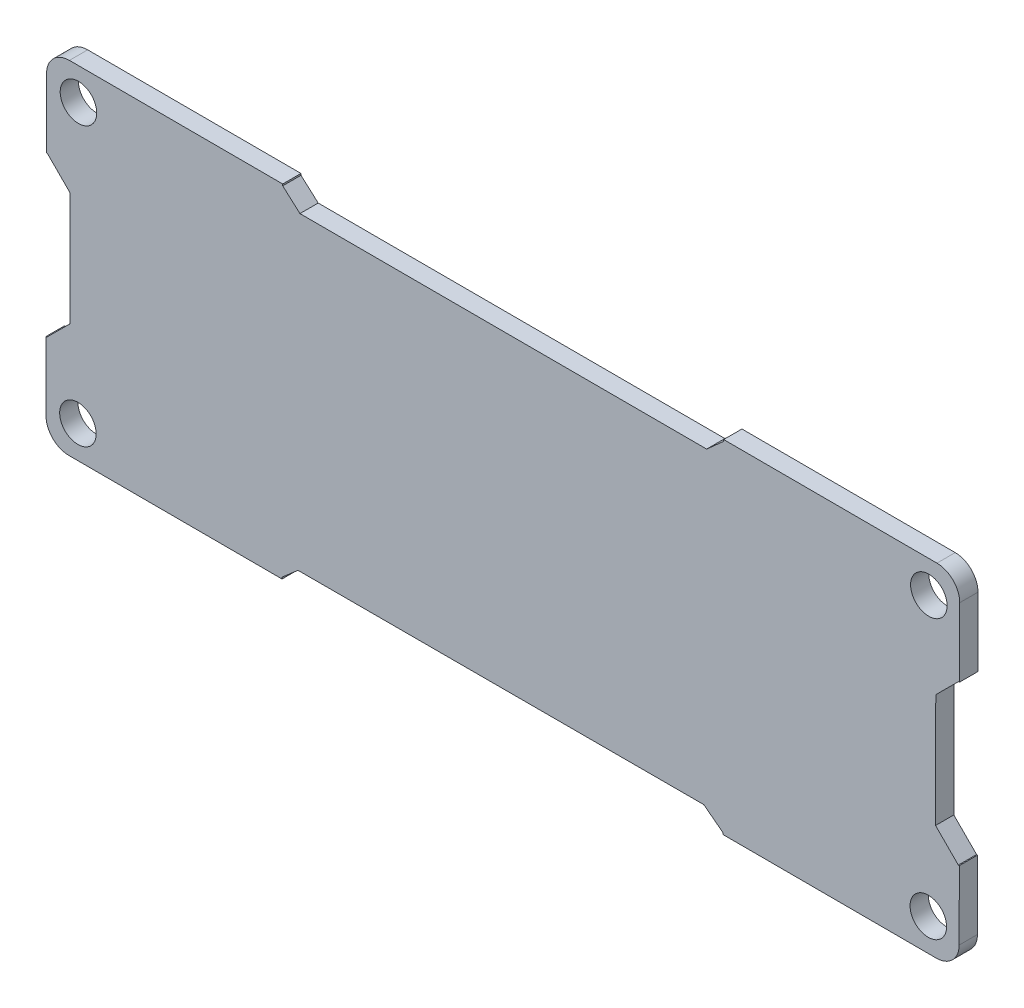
ISO-10303-21;
HEADER;
FILE_DESCRIPTION(('STEP AP214'),'2;1');
FILE_NAME('part.step','',(''),(''),'','','');
FILE_SCHEMA(('AUTOMOTIVE_DESIGN { 1 0 10303 214 1 1 1 1 }'));
ENDSEC;
DATA;
#1=APPLICATION_CONTEXT('core data for automotive mechanical design processes');
#2=APPLICATION_PROTOCOL_DEFINITION('international standard','automotive_design',2000,#1);
#3=PRODUCT_CONTEXT('',#1,'mechanical');
#4=PRODUCT('Part','Part','',(#3));
#5=PRODUCT_RELATED_PRODUCT_CATEGORY('part','',(#4));
#6=PRODUCT_DEFINITION_FORMATION('','',#4);
#7=PRODUCT_DEFINITION_CONTEXT('part definition',#1,'design');
#8=PRODUCT_DEFINITION('design','',#6,#7);
#9=PRODUCT_DEFINITION_SHAPE('','',#8);
#10=(LENGTH_UNIT() NAMED_UNIT(*) SI_UNIT(.MILLI.,.METRE.));
#11=(NAMED_UNIT(*) PLANE_ANGLE_UNIT() SI_UNIT($,.RADIAN.));
#12=(NAMED_UNIT(*) SI_UNIT($,.STERADIAN.) SOLID_ANGLE_UNIT());
#13=UNCERTAINTY_MEASURE_WITH_UNIT(LENGTH_MEASURE(1.E-05),#10,'distance_accuracy_value','');
#14=(GEOMETRIC_REPRESENTATION_CONTEXT(3) GLOBAL_UNCERTAINTY_ASSIGNED_CONTEXT((#13)) GLOBAL_UNIT_ASSIGNED_CONTEXT((#10,
#11,#12)) REPRESENTATION_CONTEXT('',''));
#15=CARTESIAN_POINT('',(0.,0.,0.));
#16=DIRECTION('',(0.,0.,1.));
#17=DIRECTION('',(1.,0.,0.));
#18=AXIS2_PLACEMENT_3D('',#15,#16,#17);
#19=CARTESIAN_POINT('',(-0.747475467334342,25.1714561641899,1.6));
#20=DIRECTION('',(0.,0.,1.));
#21=DIRECTION('',(1.,0.,0.));
#22=AXIS2_PLACEMENT_3D('',#19,#20,#21);
#23=PLANE('',#22);
#24=CARTESIAN_POINT('',(0.0460258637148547,24.3769565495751,1.6));
#25=DIRECTION('',(0.,0.,1.));
#26=DIRECTION('',(1.,0.,0.));
#27=AXIS2_PLACEMENT_3D('',#24,#25,#26);
#28=CIRCLE('',#27,1.6);
#29=CARTESIAN_POINT('',(1.64602586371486,24.3769565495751,1.6));
#30=VERTEX_POINT('',#29);
#31=EDGE_CURVE('E660',#30,#30,#28,.T.);
#32=ORIENTED_EDGE('',*,*,#31,.F.);
#33=EDGE_LOOP('',(#32));
#34=FACE_BOUND('',#33,.T.);
#35=CARTESIAN_POINT('',(74.5448930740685,24.2362960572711,1.6));
#36=DIRECTION('',(0.,0.,1.));
#37=DIRECTION('',(1.,0.,0.));
#38=AXIS2_PLACEMENT_3D('',#35,#36,#37);
#39=CIRCLE('',#38,1.60000000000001);
#40=CARTESIAN_POINT('',(76.1448930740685,24.2362960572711,1.6));
#41=VERTEX_POINT('',#40);
#42=EDGE_CURVE('E298',#41,#41,#39,.T.);
#43=ORIENTED_EDGE('',*,*,#42,.F.);
#44=EDGE_LOOP('',(#43));
#45=FACE_BOUND('',#44,.T.);
#46=DIRECTION('',(-0.00188808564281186,-0.999998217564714,0.));
#47=VECTOR('',#46,1.);
#48=CARTESIAN_POINT('',(-0.696399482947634,7.20399436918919,1.6));
#49=LINE('',#48,#47);
#50=CARTESIAN_POINT('',(-0.677641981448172,17.1386433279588,1.6));
#51=VERTEX_POINT('',#50);
#52=CARTESIAN_POINT('',(-0.696399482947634,7.20399436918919,1.6));
#53=VERTEX_POINT('',#52);
#54=EDGE_CURVE('E388',#51,#53,#49,.T.);
#55=ORIENTED_EDGE('',*,*,#54,.T.);
#56=DIRECTION('',(-0.708440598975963,-0.705770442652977,0.));
#57=VECTOR('',#56,1.);
#58=CARTESIAN_POINT('',(-2.70017208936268,5.20777410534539,1.6));
#59=LINE('',#58,#57);
#60=CARTESIAN_POINT('',(-2.70017208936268,5.20777410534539,1.6));
#61=VERTEX_POINT('',#60);
#62=EDGE_CURVE('E180',#53,#61,#59,.T.);
#63=ORIENTED_EDGE('',*,*,#62,.T.);
#64=DIRECTION('',(-0.999998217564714,0.00188808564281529,0.));
#65=VECTOR('',#64,1.);
#66=CARTESIAN_POINT('',(-2.78517193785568,5.20793459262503,1.6));
#67=LINE('',#66,#65);
#68=CARTESIAN_POINT('',(-2.78517193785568,5.20793459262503,1.6));
#69=VERTEX_POINT('',#68);
#70=EDGE_CURVE('E505',#61,#69,#67,.T.);
#71=ORIENTED_EDGE('',*,*,#70,.T.);
#72=DIRECTION('',(-0.00188808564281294,-0.999998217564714,0.));
#73=VECTOR('',#72,1.);
#74=CARTESIAN_POINT('',(-2.7965621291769,-0.824721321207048,1.6));
#75=LINE('',#74,#73);
#76=CARTESIAN_POINT('',(-2.7965621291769,-0.824721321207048,1.6));
#77=VERTEX_POINT('',#76);
#78=EDGE_CURVE('E525',#69,#77,#75,.T.);
#79=ORIENTED_EDGE('',*,*,#78,.T.);
#80=CARTESIAN_POINT('',(-0.796565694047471,-0.828497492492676,1.6));
#81=DIRECTION('',(0.,0.,1.));
#82=DIRECTION('',(1.,0.,0.));
#83=AXIS2_PLACEMENT_3D('',#80,#81,#82);
#84=CIRCLE('',#83,2.);
#85=CARTESIAN_POINT('',(-0.8003418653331,-2.82849392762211,1.6));
#86=VERTEX_POINT('',#85);
#87=EDGE_CURVE('E521',#77,#86,#84,.T.);
#88=ORIENTED_EDGE('',*,*,#87,.T.);
#89=DIRECTION('',(0.999998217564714,-0.00188808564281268,0.));
#90=VECTOR('',#89,1.);
#91=CARTESIAN_POINT('',(17.8849581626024,-2.86377343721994,1.6));
#92=LINE('',#91,#90);
#93=CARTESIAN_POINT('',(17.8849581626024,-2.86377343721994,1.6));
#94=VERTEX_POINT('',#93);
#95=EDGE_CURVE('E524',#86,#94,#92,.T.);
#96=ORIENTED_EDGE('',*,*,#95,.T.);
#97=DIRECTION('',(0.00188808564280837,0.999998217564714,0.));
#98=VECTOR('',#97,1.);
#99=CARTESIAN_POINT('',(17.88522501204,-2.72244035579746,1.6));
#100=LINE('',#99,#98);
#101=CARTESIAN_POINT('',(17.88522501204,-2.72244035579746,1.6));
#102=VERTEX_POINT('',#101);
#103=EDGE_CURVE('E529',#94,#102,#100,.T.);
#104=ORIENTED_EDGE('',*,*,#103,.T.);
#105=DIRECTION('',(0.752778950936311,0.658273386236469,0.));
#106=VECTOR('',#105,1.);
#107=CARTESIAN_POINT('',(19.2753560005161,-1.50682954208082,1.6));
#108=LINE('',#107,#106);
#109=CARTESIAN_POINT('',(19.2753560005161,-1.50682954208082,1.6));
#110=VERTEX_POINT('',#109);
#111=EDGE_CURVE('E536',#102,#110,#108,.T.);
#112=ORIENTED_EDGE('',*,*,#111,.T.);
#113=DIRECTION('',(1.,0.,0.));
#114=VECTOR('',#113,1.);
#115=CARTESIAN_POINT('',(54.831652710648,-1.50682954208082,1.6));
#116=LINE('',#115,#114);
#117=CARTESIAN_POINT('',(54.831652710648,-1.50682954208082,1.6));
#118=VERTEX_POINT('',#117);
#119=EDGE_CURVE('E539',#110,#118,#116,.T.);
#120=ORIENTED_EDGE('',*,*,#119,.T.);
#121=DIRECTION('',(0.793977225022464,-0.607947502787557,0.));
#122=VECTOR('',#121,1.);
#123=CARTESIAN_POINT('',(56.5144894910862,-2.79537584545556,1.6));
#124=LINE('',#123,#122);
#125=CARTESIAN_POINT('',(56.5144894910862,-2.79537584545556,1.6));
#126=VERTEX_POINT('',#125);
#127=EDGE_CURVE('E542',#118,#126,#124,.T.);
#128=ORIENTED_EDGE('',*,*,#127,.T.);
#129=DIRECTION('',(-0.00188808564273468,-0.999998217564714,0.));
#130=VECTOR('',#129,1.);
#131=CARTESIAN_POINT('',(56.5142226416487,-2.93670892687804,1.6));
#132=LINE('',#131,#130);
#133=CARTESIAN_POINT('',(56.5142226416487,-2.93670892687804,1.6));
#134=VERTEX_POINT('',#133);
#135=EDGE_CURVE('E545',#126,#134,#132,.T.);
#136=ORIENTED_EDGE('',*,*,#135,.T.);
#137=DIRECTION('',(0.999998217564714,-0.00188808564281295,0.));
#138=VECTOR('',#137,1.);
#139=CARTESIAN_POINT('',(75.1995226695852,-2.97198843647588,1.6));
#140=LINE('',#139,#138);
#141=CARTESIAN_POINT('',(75.1995226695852,-2.97198843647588,1.6));
#142=VERTEX_POINT('',#141);
#143=EDGE_CURVE('E548',#134,#142,#140,.T.);
#144=ORIENTED_EDGE('',*,*,#143,.T.);
#145=CARTESIAN_POINT('',(75.2032988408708,-0.971992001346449,1.6));
#146=DIRECTION('',(0.,0.,1.));
#147=DIRECTION('',(-1.,0.,0.));
#148=AXIS2_PLACEMENT_3D('',#145,#146,#147);
#149=CIRCLE('',#148,2.00000000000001);
#150=CARTESIAN_POINT('',(77.2032952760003,-0.975768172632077,1.6));
#151=VERTEX_POINT('',#150);
#152=EDGE_CURVE('E551',#142,#151,#149,.T.);
#153=ORIENTED_EDGE('',*,*,#152,.T.);
#154=DIRECTION('',(0.00188808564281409,0.999998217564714,0.));
#155=VECTOR('',#154,1.);
#156=CARTESIAN_POINT('',(77.2146854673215,5.0568877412,1.6));
#157=LINE('',#156,#155);
#158=CARTESIAN_POINT('',(77.2146854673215,5.0568877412,1.6));
#159=VERTEX_POINT('',#158);
#160=EDGE_CURVE('E554',#151,#159,#157,.T.);
#161=ORIENTED_EDGE('',*,*,#160,.T.);
#162=DIRECTION('',(-0.999998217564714,0.0018880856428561,0.));
#163=VECTOR('',#162,1.);
#164=CARTESIAN_POINT('',(77.1296856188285,5.05704822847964,1.6));
#165=LINE('',#164,#163);
#166=CARTESIAN_POINT('',(77.1296856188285,5.05704822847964,1.6));
#167=VERTEX_POINT('',#166);
#168=EDGE_CURVE('E557',#159,#167,#165,.T.);
#169=ORIENTED_EDGE('',*,*,#168,.T.);
#170=DIRECTION('',(-0.705770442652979,0.708440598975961,0.));
#171=VECTOR('',#170,1.);
#172=CARTESIAN_POINT('',(75.1334653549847,7.06082083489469,1.6));
#173=LINE('',#172,#171);
#174=CARTESIAN_POINT('',(75.1334653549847,7.06082083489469,1.6));
#175=VERTEX_POINT('',#174);
#176=EDGE_CURVE('E560',#167,#175,#173,.T.);
#177=ORIENTED_EDGE('',*,*,#176,.T.);
#178=DIRECTION('',(0.00188808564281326,0.999998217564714,0.));
#179=VECTOR('',#178,1.);
#180=CARTESIAN_POINT('',(75.1522228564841,16.9954697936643,1.6));
#181=LINE('',#180,#179);
#182=CARTESIAN_POINT('',(75.1522228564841,16.9954697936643,1.6));
#183=VERTEX_POINT('',#182);
#184=EDGE_CURVE('E563',#175,#183,#181,.T.);
#185=ORIENTED_EDGE('',*,*,#184,.T.);
#186=DIRECTION('',(0.708440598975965,0.705770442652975,0.));
#187=VECTOR('',#186,1.);
#188=CARTESIAN_POINT('',(77.1559954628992,18.9916900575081,1.6));
#189=LINE('',#188,#187);
#190=CARTESIAN_POINT('',(77.1559954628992,18.9916900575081,1.6));
#191=VERTEX_POINT('',#190);
#192=EDGE_CURVE('E566',#183,#191,#189,.T.);
#193=ORIENTED_EDGE('',*,*,#192,.T.);
#194=DIRECTION('',(0.999998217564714,-0.00188808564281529,0.));
#195=VECTOR('',#194,1.);
#196=CARTESIAN_POINT('',(77.2409953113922,18.9915295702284,1.6));
#197=LINE('',#196,#195);
#198=CARTESIAN_POINT('',(77.2409953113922,18.9915295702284,1.6));
#199=VERTEX_POINT('',#198);
#200=EDGE_CURVE('E569',#191,#199,#197,.T.);
#201=ORIENTED_EDGE('',*,*,#200,.T.);
#202=DIRECTION('',(0.00188808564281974,0.999998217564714,0.));
#203=VECTOR('',#202,1.);
#204=CARTESIAN_POINT('',(77.2523855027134,25.0241854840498,1.6));
#205=LINE('',#204,#203);
#206=CARTESIAN_POINT('',(77.2523855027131,25.0241854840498,1.6));
#207=VERTEX_POINT('',#206);
#208=EDGE_CURVE('E572',#199,#207,#205,.T.);
#209=ORIENTED_EDGE('',*,*,#208,.T.);
#210=CARTESIAN_POINT('',(75.252389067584,25.0279616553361,1.6));
#211=DIRECTION('',(0.,0.,1.));
#212=DIRECTION('',(-1.,0.,0.));
#213=AXIS2_PLACEMENT_3D('',#210,#211,#212);
#214=CIRCLE('',#213,1.99999999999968);
#215=CARTESIAN_POINT('',(75.2561652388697,27.0279580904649,1.6));
#216=VERTEX_POINT('',#215);
#217=EDGE_CURVE('E575',#207,#216,#214,.T.);
#218=ORIENTED_EDGE('',*,*,#217,.T.);
#219=DIRECTION('',(-0.999998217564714,0.00188808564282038,0.));
#220=VECTOR('',#219,1.);
#221=CARTESIAN_POINT('',(56.5708652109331,27.0632376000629,1.6));
#222=LINE('',#221,#220);
#223=CARTESIAN_POINT('',(56.5708652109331,27.0632376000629,1.6));
#224=VERTEX_POINT('',#223);
#225=EDGE_CURVE('E578',#216,#224,#222,.T.);
#226=ORIENTED_EDGE('',*,*,#225,.T.);
#227=DIRECTION('',(-0.00188808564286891,-0.999998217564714,0.));
#228=VECTOR('',#227,1.);
#229=CARTESIAN_POINT('',(56.5705983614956,26.9219045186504,1.6));
#230=LINE('',#229,#228);
#231=CARTESIAN_POINT('',(56.5705983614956,26.9219045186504,1.6));
#232=VERTEX_POINT('',#231);
#233=EDGE_CURVE('E581',#224,#232,#230,.T.);
#234=ORIENTED_EDGE('',*,*,#233,.T.);
#235=DIRECTION('',(-0.74650461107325,-0.665380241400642,0.));
#236=VECTOR('',#235,1.);
#237=CARTESIAN_POINT('',(55.0790188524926,25.5924183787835,1.6));
#238=LINE('',#237,#236);
#239=CARTESIAN_POINT('',(55.0790188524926,25.5924183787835,1.6));
#240=VERTEX_POINT('',#239);
#241=EDGE_CURVE('E584',#232,#240,#238,.T.);
#242=ORIENTED_EDGE('',*,*,#241,.T.);
#243=DIRECTION('',(-0.999998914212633,0.00147362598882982,0.));
#244=VECTOR('',#243,1.);
#245=CARTESIAN_POINT('',(19.4503878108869,25.6449217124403,1.6));
#246=LINE('',#245,#244);
#247=CARTESIAN_POINT('',(19.4503878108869,25.6449217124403,1.6));
#248=VERTEX_POINT('',#247);
#249=EDGE_CURVE('E587',#240,#248,#246,.T.);
#250=ORIENTED_EDGE('',*,*,#249,.T.);
#251=DIRECTION('',(-0.745311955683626,0.666715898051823,0.));
#252=VECTOR('',#251,1.);
#253=CARTESIAN_POINT('',(17.9413338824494,26.9948400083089,1.6));
#254=LINE('',#253,#252);
#255=CARTESIAN_POINT('',(17.9413338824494,26.9948400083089,1.6));
#256=VERTEX_POINT('',#255);
#257=EDGE_CURVE('E590',#248,#256,#254,.T.);
#258=ORIENTED_EDGE('',*,*,#257,.T.);
#259=DIRECTION('',(0.00188808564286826,0.999998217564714,0.));
#260=VECTOR('',#259,1.);
#261=CARTESIAN_POINT('',(17.9416007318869,27.1361730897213,1.6));
#262=LINE('',#261,#260);
#263=CARTESIAN_POINT('',(17.9416007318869,27.1361730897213,1.6));
#264=VERTEX_POINT('',#263);
#265=EDGE_CURVE('E593',#256,#264,#262,.T.);
#266=ORIENTED_EDGE('',*,*,#265,.T.);
#267=DIRECTION('',(-0.999998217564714,0.0018880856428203,0.));
#268=VECTOR('',#267,1.);
#269=CARTESIAN_POINT('',(-0.743699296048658,27.1714525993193,1.6));
#270=LINE('',#269,#268);
#271=CARTESIAN_POINT('',(-0.743699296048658,27.1714525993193,1.6));
#272=VERTEX_POINT('',#271);
#273=EDGE_CURVE('E596',#264,#272,#270,.T.);
#274=ORIENTED_EDGE('',*,*,#273,.T.);
#275=CARTESIAN_POINT('',(-0.747475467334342,25.1714561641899,1.6));
#276=DIRECTION('',(0.,0.,1.));
#277=DIRECTION('',(1.,0.,0.));
#278=AXIS2_PLACEMENT_3D('',#275,#276,#277);
#279=CIRCLE('',#278,1.99999999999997);
#280=CARTESIAN_POINT('',(-2.74747190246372,25.1752323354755,1.6));
#281=VERTEX_POINT('',#280);
#282=EDGE_CURVE('E271',#272,#281,#279,.T.);
#283=ORIENTED_EDGE('',*,*,#282,.T.);
#284=DIRECTION('',(-0.00188808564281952,-0.999998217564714,0.));
#285=VECTOR('',#284,1.);
#286=CARTESIAN_POINT('',(-2.75886209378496,19.1425764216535,1.6));
#287=LINE('',#286,#285);
#288=CARTESIAN_POINT('',(-2.75886209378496,19.1425764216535,1.6));
#289=VERTEX_POINT('',#288);
#290=EDGE_CURVE('E265',#281,#289,#287,.T.);
#291=ORIENTED_EDGE('',*,*,#290,.T.);
#292=DIRECTION('',(0.999998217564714,-0.00188808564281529,0.));
#293=VECTOR('',#292,1.);
#294=CARTESIAN_POINT('',(-2.67386224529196,19.1424159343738,1.6));
#295=LINE('',#294,#293);
#296=CARTESIAN_POINT('',(-2.67386224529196,19.1424159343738,1.6));
#297=VERTEX_POINT('',#296);
#298=EDGE_CURVE('E269',#289,#297,#295,.T.);
#299=ORIENTED_EDGE('',*,*,#298,.T.);
#300=DIRECTION('',(0.705770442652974,-0.708440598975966,0.));
#301=VECTOR('',#300,1.);
#302=CARTESIAN_POINT('',(-0.677641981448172,17.1386433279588,1.6));
#303=LINE('',#302,#301);
#304=EDGE_CURVE('E65',#297,#51,#303,.T.);
#305=ORIENTED_EDGE('',*,*,#304,.T.);
#306=EDGE_LOOP('',(#55,#63,#71,#79,#88,#96,#104,#112,#120,#128,#136,#144,#153,#161,#169,#177,
#185,#193,#201,#209,#218,#226,#234,#242,#250,#258,#266,#274,#283,#291,#299,#305));
#307=FACE_BOUND('',#306,.T.);
#308=CARTESIAN_POINT('',(0.,0.,1.6));
#309=DIRECTION('',(0.,0.,1.));
#310=DIRECTION('',(1.,0.,0.));
#311=AXIS2_PLACEMENT_3D('',#308,#309,#310);
#312=CIRCLE('',#311,1.6);
#313=CARTESIAN_POINT('',(1.60000000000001,0.,1.6));
#314=VERTEX_POINT('',#313);
#315=EDGE_CURVE('E668',#314,#314,#312,.T.);
#316=ORIENTED_EDGE('',*,*,#315,.F.);
#317=EDGE_LOOP('',(#316));
#318=FACE_BOUND('',#317,.T.);
#319=CARTESIAN_POINT('',(74.4988672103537,-0.140660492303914,1.6));
#320=DIRECTION('',(0.,0.,1.));
#321=DIRECTION('',(1.,0.,0.));
#322=AXIS2_PLACEMENT_3D('',#319,#320,#321);
#323=CIRCLE('',#322,1.60000000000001);
#324=CARTESIAN_POINT('',(76.0988672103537,-0.140660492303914,1.6));
#325=VERTEX_POINT('',#324);
#326=EDGE_CURVE('E649',#325,#325,#323,.T.);
#327=ORIENTED_EDGE('',*,*,#326,.F.);
#328=EDGE_LOOP('',(#327));
#329=FACE_BOUND('',#328,.T.);
#330=ADVANCED_FACE('F47',(#34,#45,#307,#318,#329),#23,.T.);
#331=CARTESIAN_POINT('',(-0.747475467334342,25.1714561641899,0.));
#332=DIRECTION('',(0.,0.,1.));
#333=DIRECTION('',(1.,0.,0.));
#334=AXIS2_PLACEMENT_3D('',#331,#332,#333);
#335=PLANE('',#334);
#336=DIRECTION('',(-0.00188808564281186,-0.999998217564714,0.));
#337=VECTOR('',#336,1.);
#338=CARTESIAN_POINT('',(-0.696399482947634,7.20399436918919,0.));
#339=LINE('',#338,#337);
#340=CARTESIAN_POINT('',(-0.677641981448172,17.1386433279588,0.));
#341=VERTEX_POINT('',#340);
#342=CARTESIAN_POINT('',(-0.696399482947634,7.20399436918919,0.));
#343=VERTEX_POINT('',#342);
#344=EDGE_CURVE('E293',#341,#343,#339,.T.);
#345=ORIENTED_EDGE('',*,*,#344,.F.);
#346=DIRECTION('',(0.705770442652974,-0.708440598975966,0.));
#347=VECTOR('',#346,1.);
#348=CARTESIAN_POINT('',(-0.677641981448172,17.1386433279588,0.));
#349=LINE('',#348,#347);
#350=CARTESIAN_POINT('',(-2.67386224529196,19.1424159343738,0.));
#351=VERTEX_POINT('',#350);
#352=EDGE_CURVE('E172',#351,#341,#349,.T.);
#353=ORIENTED_EDGE('',*,*,#352,.F.);
#354=DIRECTION('',(0.999998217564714,-0.00188808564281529,0.));
#355=VECTOR('',#354,1.);
#356=CARTESIAN_POINT('',(-2.67386224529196,19.1424159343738,0.));
#357=LINE('',#356,#355);
#358=CARTESIAN_POINT('',(-2.75886209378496,19.1425764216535,0.));
#359=VERTEX_POINT('',#358);
#360=EDGE_CURVE('E166',#359,#351,#357,.T.);
#361=ORIENTED_EDGE('',*,*,#360,.F.);
#362=DIRECTION('',(-0.00188808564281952,-0.999998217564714,0.));
#363=VECTOR('',#362,1.);
#364=CARTESIAN_POINT('',(-2.75886209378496,19.1425764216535,0.));
#365=LINE('',#364,#363);
#366=CARTESIAN_POINT('',(-2.74747190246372,25.1752323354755,0.));
#367=VERTEX_POINT('',#366);
#368=EDGE_CURVE('E280',#367,#359,#365,.T.);
#369=ORIENTED_EDGE('',*,*,#368,.F.);
#370=CARTESIAN_POINT('',(-0.747475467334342,25.1714561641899,0.));
#371=DIRECTION('',(0.,0.,1.));
#372=DIRECTION('',(1.,0.,0.));
#373=AXIS2_PLACEMENT_3D('',#370,#371,#372);
#374=CIRCLE('',#373,1.99999999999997);
#375=CARTESIAN_POINT('',(-0.743699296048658,27.1714525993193,0.));
#376=VERTEX_POINT('',#375);
#377=EDGE_CURVE('E379',#376,#367,#374,.T.);
#378=ORIENTED_EDGE('',*,*,#377,.F.);
#379=DIRECTION('',(-0.999998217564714,0.0018880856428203,0.));
#380=VECTOR('',#379,1.);
#381=CARTESIAN_POINT('',(-0.743699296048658,27.1714525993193,0.));
#382=LINE('',#381,#380);
#383=CARTESIAN_POINT('',(17.9416007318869,27.1361730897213,0.));
#384=VERTEX_POINT('',#383);
#385=EDGE_CURVE('E376',#384,#376,#382,.T.);
#386=ORIENTED_EDGE('',*,*,#385,.F.);
#387=DIRECTION('',(0.00188808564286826,0.999998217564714,0.));
#388=VECTOR('',#387,1.);
#389=CARTESIAN_POINT('',(17.9416007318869,27.1361730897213,0.));
#390=LINE('',#389,#388);
#391=CARTESIAN_POINT('',(17.9413338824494,26.9948400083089,0.));
#392=VERTEX_POINT('',#391);
#393=EDGE_CURVE('E373',#392,#384,#390,.T.);
#394=ORIENTED_EDGE('',*,*,#393,.F.);
#395=DIRECTION('',(-0.745311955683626,0.666715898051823,0.));
#396=VECTOR('',#395,1.);
#397=CARTESIAN_POINT('',(17.9413338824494,26.9948400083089,0.));
#398=LINE('',#397,#396);
#399=CARTESIAN_POINT('',(19.4503878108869,25.6449217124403,0.));
#400=VERTEX_POINT('',#399);
#401=EDGE_CURVE('E370',#400,#392,#398,.T.);
#402=ORIENTED_EDGE('',*,*,#401,.F.);
#403=DIRECTION('',(-0.999998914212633,0.00147362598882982,0.));
#404=VECTOR('',#403,1.);
#405=CARTESIAN_POINT('',(19.4503878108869,25.6449217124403,0.));
#406=LINE('',#405,#404);
#407=CARTESIAN_POINT('',(55.0790188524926,25.5924183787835,0.));
#408=VERTEX_POINT('',#407);
#409=EDGE_CURVE('E367',#408,#400,#406,.T.);
#410=ORIENTED_EDGE('',*,*,#409,.F.);
#411=DIRECTION('',(-0.74650461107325,-0.665380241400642,0.));
#412=VECTOR('',#411,1.);
#413=CARTESIAN_POINT('',(55.0790188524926,25.5924183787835,0.));
#414=LINE('',#413,#412);
#415=CARTESIAN_POINT('',(56.5705983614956,26.9219045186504,0.));
#416=VERTEX_POINT('',#415);
#417=EDGE_CURVE('E364',#416,#408,#414,.T.);
#418=ORIENTED_EDGE('',*,*,#417,.F.);
#419=DIRECTION('',(-0.00188808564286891,-0.999998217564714,0.));
#420=VECTOR('',#419,1.);
#421=CARTESIAN_POINT('',(56.5705983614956,26.9219045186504,0.));
#422=LINE('',#421,#420);
#423=CARTESIAN_POINT('',(56.5708652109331,27.0632376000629,0.));
#424=VERTEX_POINT('',#423);
#425=EDGE_CURVE('E361',#424,#416,#422,.T.);
#426=ORIENTED_EDGE('',*,*,#425,.F.);
#427=DIRECTION('',(-0.999998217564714,0.00188808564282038,0.));
#428=VECTOR('',#427,1.);
#429=CARTESIAN_POINT('',(56.5708652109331,27.0632376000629,0.));
#430=LINE('',#429,#428);
#431=CARTESIAN_POINT('',(75.2561652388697,27.0279580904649,0.));
#432=VERTEX_POINT('',#431);
#433=EDGE_CURVE('E358',#432,#424,#430,.T.);
#434=ORIENTED_EDGE('',*,*,#433,.F.);
#435=CARTESIAN_POINT('',(75.252389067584,25.0279616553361,0.));
#436=DIRECTION('',(0.,0.,1.));
#437=DIRECTION('',(-1.,0.,0.));
#438=AXIS2_PLACEMENT_3D('',#435,#436,#437);
#439=CIRCLE('',#438,1.99999999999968);
#440=CARTESIAN_POINT('',(77.2523855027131,25.0241854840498,0.));
#441=VERTEX_POINT('',#440);
#442=EDGE_CURVE('E355',#441,#432,#439,.T.);
#443=ORIENTED_EDGE('',*,*,#442,.F.);
#444=DIRECTION('',(0.00188808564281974,0.999998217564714,0.));
#445=VECTOR('',#444,1.);
#446=CARTESIAN_POINT('',(77.2523855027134,25.0241854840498,0.));
#447=LINE('',#446,#445);
#448=CARTESIAN_POINT('',(77.2409953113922,18.9915295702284,0.));
#449=VERTEX_POINT('',#448);
#450=EDGE_CURVE('E352',#449,#441,#447,.T.);
#451=ORIENTED_EDGE('',*,*,#450,.F.);
#452=DIRECTION('',(0.999998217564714,-0.00188808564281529,0.));
#453=VECTOR('',#452,1.);
#454=CARTESIAN_POINT('',(77.2409953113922,18.9915295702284,0.));
#455=LINE('',#454,#453);
#456=CARTESIAN_POINT('',(77.1559954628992,18.9916900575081,0.));
#457=VERTEX_POINT('',#456);
#458=EDGE_CURVE('E349',#457,#449,#455,.T.);
#459=ORIENTED_EDGE('',*,*,#458,.F.);
#460=DIRECTION('',(0.708440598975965,0.705770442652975,0.));
#461=VECTOR('',#460,1.);
#462=CARTESIAN_POINT('',(77.1559954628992,18.9916900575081,0.));
#463=LINE('',#462,#461);
#464=CARTESIAN_POINT('',(75.1522228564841,16.9954697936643,0.));
#465=VERTEX_POINT('',#464);
#466=EDGE_CURVE('E346',#465,#457,#463,.T.);
#467=ORIENTED_EDGE('',*,*,#466,.F.);
#468=DIRECTION('',(0.00188808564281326,0.999998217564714,0.));
#469=VECTOR('',#468,1.);
#470=CARTESIAN_POINT('',(75.1522228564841,16.9954697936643,0.));
#471=LINE('',#470,#469);
#472=CARTESIAN_POINT('',(75.1334653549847,7.06082083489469,0.));
#473=VERTEX_POINT('',#472);
#474=EDGE_CURVE('E343',#473,#465,#471,.T.);
#475=ORIENTED_EDGE('',*,*,#474,.F.);
#476=DIRECTION('',(-0.705770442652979,0.708440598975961,0.));
#477=VECTOR('',#476,1.);
#478=CARTESIAN_POINT('',(75.1334653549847,7.06082083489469,0.));
#479=LINE('',#478,#477);
#480=CARTESIAN_POINT('',(77.1296856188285,5.05704822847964,0.));
#481=VERTEX_POINT('',#480);
#482=EDGE_CURVE('E340',#481,#473,#479,.T.);
#483=ORIENTED_EDGE('',*,*,#482,.F.);
#484=DIRECTION('',(-0.999998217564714,0.0018880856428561,0.));
#485=VECTOR('',#484,1.);
#486=CARTESIAN_POINT('',(77.1296856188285,5.05704822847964,0.));
#487=LINE('',#486,#485);
#488=CARTESIAN_POINT('',(77.2146854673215,5.0568877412,0.));
#489=VERTEX_POINT('',#488);
#490=EDGE_CURVE('E337',#489,#481,#487,.T.);
#491=ORIENTED_EDGE('',*,*,#490,.F.);
#492=DIRECTION('',(0.00188808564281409,0.999998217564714,0.));
#493=VECTOR('',#492,1.);
#494=CARTESIAN_POINT('',(77.2146854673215,5.0568877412,0.));
#495=LINE('',#494,#493);
#496=CARTESIAN_POINT('',(77.2032952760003,-0.975768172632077,0.));
#497=VERTEX_POINT('',#496);
#498=EDGE_CURVE('E334',#497,#489,#495,.T.);
#499=ORIENTED_EDGE('',*,*,#498,.F.);
#500=CARTESIAN_POINT('',(75.2032988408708,-0.971992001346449,0.));
#501=DIRECTION('',(0.,0.,1.));
#502=DIRECTION('',(-1.,0.,0.));
#503=AXIS2_PLACEMENT_3D('',#500,#501,#502);
#504=CIRCLE('',#503,2.00000000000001);
#505=CARTESIAN_POINT('',(75.1995226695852,-2.97198843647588,0.));
#506=VERTEX_POINT('',#505);
#507=EDGE_CURVE('E331',#506,#497,#504,.T.);
#508=ORIENTED_EDGE('',*,*,#507,.F.);
#509=DIRECTION('',(0.999998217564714,-0.00188808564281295,0.));
#510=VECTOR('',#509,1.);
#511=CARTESIAN_POINT('',(75.1995226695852,-2.97198843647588,0.));
#512=LINE('',#511,#510);
#513=CARTESIAN_POINT('',(56.5142226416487,-2.93670892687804,0.));
#514=VERTEX_POINT('',#513);
#515=EDGE_CURVE('E328',#514,#506,#512,.T.);
#516=ORIENTED_EDGE('',*,*,#515,.F.);
#517=DIRECTION('',(-0.00188808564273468,-0.999998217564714,0.));
#518=VECTOR('',#517,1.);
#519=CARTESIAN_POINT('',(56.5142226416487,-2.93670892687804,0.));
#520=LINE('',#519,#518);
#521=CARTESIAN_POINT('',(56.5144894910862,-2.79537584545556,0.));
#522=VERTEX_POINT('',#521);
#523=EDGE_CURVE('E325',#522,#514,#520,.T.);
#524=ORIENTED_EDGE('',*,*,#523,.F.);
#525=DIRECTION('',(0.793977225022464,-0.607947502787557,0.));
#526=VECTOR('',#525,1.);
#527=CARTESIAN_POINT('',(56.5144894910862,-2.79537584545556,0.));
#528=LINE('',#527,#526);
#529=CARTESIAN_POINT('',(54.831652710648,-1.50682954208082,0.));
#530=VERTEX_POINT('',#529);
#531=EDGE_CURVE('E322',#530,#522,#528,.T.);
#532=ORIENTED_EDGE('',*,*,#531,.F.);
#533=DIRECTION('',(1.,0.,0.));
#534=VECTOR('',#533,1.);
#535=CARTESIAN_POINT('',(54.831652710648,-1.50682954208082,0.));
#536=LINE('',#535,#534);
#537=CARTESIAN_POINT('',(19.2753560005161,-1.50682954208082,0.));
#538=VERTEX_POINT('',#537);
#539=EDGE_CURVE('E319',#538,#530,#536,.T.);
#540=ORIENTED_EDGE('',*,*,#539,.F.);
#541=DIRECTION('',(0.752778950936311,0.658273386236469,0.));
#542=VECTOR('',#541,1.);
#543=CARTESIAN_POINT('',(19.2753560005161,-1.50682954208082,0.));
#544=LINE('',#543,#542);
#545=CARTESIAN_POINT('',(17.88522501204,-2.72244035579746,0.));
#546=VERTEX_POINT('',#545);
#547=EDGE_CURVE('E316',#546,#538,#544,.T.);
#548=ORIENTED_EDGE('',*,*,#547,.F.);
#549=DIRECTION('',(0.00188808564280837,0.999998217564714,0.));
#550=VECTOR('',#549,1.);
#551=CARTESIAN_POINT('',(17.88522501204,-2.72244035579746,0.));
#552=LINE('',#551,#550);
#553=CARTESIAN_POINT('',(17.8849581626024,-2.86377343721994,0.));
#554=VERTEX_POINT('',#553);
#555=EDGE_CURVE('E313',#554,#546,#552,.T.);
#556=ORIENTED_EDGE('',*,*,#555,.F.);
#557=DIRECTION('',(0.999998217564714,-0.00188808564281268,0.));
#558=VECTOR('',#557,1.);
#559=CARTESIAN_POINT('',(17.8849581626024,-2.86377343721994,0.));
#560=LINE('',#559,#558);
#561=CARTESIAN_POINT('',(-0.8003418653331,-2.82849392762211,0.));
#562=VERTEX_POINT('',#561);
#563=EDGE_CURVE('E310',#562,#554,#560,.T.);
#564=ORIENTED_EDGE('',*,*,#563,.F.);
#565=CARTESIAN_POINT('',(-0.796565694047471,-0.828497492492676,0.));
#566=DIRECTION('',(0.,0.,1.));
#567=DIRECTION('',(1.,0.,0.));
#568=AXIS2_PLACEMENT_3D('',#565,#566,#567);
#569=CIRCLE('',#568,2.);
#570=CARTESIAN_POINT('',(-2.7965621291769,-0.824721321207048,0.));
#571=VERTEX_POINT('',#570);
#572=EDGE_CURVE('E307',#571,#562,#569,.T.);
#573=ORIENTED_EDGE('',*,*,#572,.F.);
#574=DIRECTION('',(-0.00188808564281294,-0.999998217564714,0.));
#575=VECTOR('',#574,1.);
#576=CARTESIAN_POINT('',(-2.7965621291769,-0.824721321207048,0.));
#577=LINE('',#576,#575);
#578=CARTESIAN_POINT('',(-2.78517193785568,5.20793459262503,0.));
#579=VERTEX_POINT('',#578);
#580=EDGE_CURVE('E304',#579,#571,#577,.T.);
#581=ORIENTED_EDGE('',*,*,#580,.F.);
#582=DIRECTION('',(-0.999998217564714,0.00188808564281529,0.));
#583=VECTOR('',#582,1.);
#584=CARTESIAN_POINT('',(-2.78517193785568,5.20793459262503,0.));
#585=LINE('',#584,#583);
#586=CARTESIAN_POINT('',(-2.70017208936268,5.20777410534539,0.));
#587=VERTEX_POINT('',#586);
#588=EDGE_CURVE('E301',#587,#579,#585,.T.);
#589=ORIENTED_EDGE('',*,*,#588,.F.);
#590=DIRECTION('',(-0.708440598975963,-0.705770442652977,0.));
#591=VECTOR('',#590,1.);
#592=CARTESIAN_POINT('',(-2.70017208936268,5.20777410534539,0.));
#593=LINE('',#592,#591);
#594=EDGE_CURVE('E297',#343,#587,#593,.T.);
#595=ORIENTED_EDGE('',*,*,#594,.F.);
#596=EDGE_LOOP('',(#345,#353,#361,#369,#378,#386,#394,#402,#410,#418,#426,#434,#443,#451,#459,
#467,#475,#483,#491,#499,#508,#516,#524,#532,#540,#548,#556,#564,#573,#581,#589,#595));
#597=FACE_BOUND('',#596,.T.);
#598=CARTESIAN_POINT('',(74.5448930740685,24.2362960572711,0.));
#599=DIRECTION('',(0.,0.,1.));
#600=DIRECTION('',(1.,0.,0.));
#601=AXIS2_PLACEMENT_3D('',#598,#599,#600);
#602=CIRCLE('',#601,1.60000000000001);
#603=CARTESIAN_POINT('',(76.1448930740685,24.2362960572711,0.));
#604=VERTEX_POINT('',#603);
#605=EDGE_CURVE('E672',#604,#604,#602,.T.);
#606=ORIENTED_EDGE('',*,*,#605,.T.);
#607=EDGE_LOOP('',(#606));
#608=FACE_BOUND('',#607,.T.);
#609=CARTESIAN_POINT('',(0.,0.,0.));
#610=DIRECTION('',(0.,0.,1.));
#611=DIRECTION('',(1.,0.,0.));
#612=AXIS2_PLACEMENT_3D('',#609,#610,#611);
#613=CIRCLE('',#612,1.6);
#614=CARTESIAN_POINT('',(1.60000000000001,0.,0.));
#615=VERTEX_POINT('',#614);
#616=EDGE_CURVE('E664',#615,#615,#613,.T.);
#617=ORIENTED_EDGE('',*,*,#616,.T.);
#618=EDGE_LOOP('',(#617));
#619=FACE_BOUND('',#618,.T.);
#620=CARTESIAN_POINT('',(0.0460258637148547,24.3769565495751,0.));
#621=DIRECTION('',(0.,0.,1.));
#622=DIRECTION('',(1.,0.,0.));
#623=AXIS2_PLACEMENT_3D('',#620,#621,#622);
#624=CIRCLE('',#623,1.6);
#625=CARTESIAN_POINT('',(1.64602586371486,24.3769565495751,0.));
#626=VERTEX_POINT('',#625);
#627=EDGE_CURVE('E657',#626,#626,#624,.T.);
#628=ORIENTED_EDGE('',*,*,#627,.T.);
#629=EDGE_LOOP('',(#628));
#630=FACE_BOUND('',#629,.T.);
#631=CARTESIAN_POINT('',(74.4988672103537,-0.140660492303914,0.));
#632=DIRECTION('',(0.,0.,1.));
#633=DIRECTION('',(1.,0.,0.));
#634=AXIS2_PLACEMENT_3D('',#631,#632,#633);
#635=CIRCLE('',#634,1.60000000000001);
#636=CARTESIAN_POINT('',(76.0988672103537,-0.140660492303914,0.));
#637=VERTEX_POINT('',#636);
#638=EDGE_CURVE('E652',#637,#637,#635,.T.);
#639=ORIENTED_EDGE('',*,*,#638,.T.);
#640=EDGE_LOOP('',(#639));
#641=FACE_BOUND('',#640,.T.);
#642=ADVANCED_FACE('F509',(#597,#608,#619,#630,#641),#335,.F.);
#643=CARTESIAN_POINT('',(-0.696399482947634,7.20399436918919,1.6));
#644=DIRECTION('',(0.999998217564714,-0.00188808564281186,0.));
#645=DIRECTION('',(0.00188808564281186,0.999998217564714,0.));
#646=AXIS2_PLACEMENT_3D('',#643,#644,#645);
#647=PLANE('',#646);
#648=ORIENTED_EDGE('',*,*,#344,.T.);
#649=DIRECTION('',(0.,0.,-1.));
#650=VECTOR('',#649,1.);
#651=CARTESIAN_POINT('',(-0.696399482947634,7.20399436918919,1.6));
#652=LINE('',#651,#650);
#653=EDGE_CURVE('E11',#53,#343,#652,.T.);
#654=ORIENTED_EDGE('',*,*,#653,.F.);
#655=ORIENTED_EDGE('',*,*,#54,.F.);
#656=DIRECTION('',(0.,0.,-1.));
#657=VECTOR('',#656,1.);
#658=CARTESIAN_POINT('',(-0.677641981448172,17.1386433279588,1.6));
#659=LINE('',#658,#657);
#660=EDGE_CURVE('E289',#51,#341,#659,.T.);
#661=ORIENTED_EDGE('',*,*,#660,.T.);
#662=EDGE_LOOP('',(#648,#654,#655,#661));
#663=FACE_BOUND('',#662,.T.);
#664=ADVANCED_FACE('F49',(#663),#647,.F.);
#665=CARTESIAN_POINT('',(-2.70017208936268,5.20777410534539,1.6));
#666=DIRECTION('',(0.705770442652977,-0.708440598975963,0.));
#667=DIRECTION('',(0.708440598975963,0.705770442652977,0.));
#668=AXIS2_PLACEMENT_3D('',#665,#666,#667);
#669=PLANE('',#668);
#670=ORIENTED_EDGE('',*,*,#594,.T.);
#671=DIRECTION('',(0.,0.,-1.));
#672=VECTOR('',#671,1.);
#673=CARTESIAN_POINT('',(-2.70017208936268,5.20777410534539,1.6));
#674=LINE('',#673,#672);
#675=EDGE_CURVE('E57',#61,#587,#674,.T.);
#676=ORIENTED_EDGE('',*,*,#675,.F.);
#677=ORIENTED_EDGE('',*,*,#62,.F.);
#678=ORIENTED_EDGE('',*,*,#653,.T.);
#679=EDGE_LOOP('',(#670,#676,#677,#678));
#680=FACE_BOUND('',#679,.T.);
#681=ADVANCED_FACE('F992',(#680),#669,.F.);
#682=CARTESIAN_POINT('',(-2.78517193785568,5.20793459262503,1.6));
#683=DIRECTION('',(-0.00188808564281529,-0.999998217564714,0.));
#684=DIRECTION('',(0.999998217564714,-0.00188808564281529,0.));
#685=AXIS2_PLACEMENT_3D('',#682,#683,#684);
#686=PLANE('',#685);
#687=ORIENTED_EDGE('',*,*,#588,.T.);
#688=DIRECTION('',(0.,0.,-1.));
#689=VECTOR('',#688,1.);
#690=CARTESIAN_POINT('',(-2.78517193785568,5.20793459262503,1.6));
#691=LINE('',#690,#689);
#692=EDGE_CURVE('E495',#69,#579,#691,.T.);
#693=ORIENTED_EDGE('',*,*,#692,.F.);
#694=ORIENTED_EDGE('',*,*,#70,.F.);
#695=ORIENTED_EDGE('',*,*,#675,.T.);
#696=EDGE_LOOP('',(#687,#693,#694,#695));
#697=FACE_BOUND('',#696,.T.);
#698=ADVANCED_FACE('F503',(#697),#686,.F.);
#699=CARTESIAN_POINT('',(-2.7965621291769,-0.824721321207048,1.6));
#700=DIRECTION('',(0.999998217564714,-0.00188808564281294,0.));
#701=DIRECTION('',(0.00188808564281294,0.999998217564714,0.));
#702=AXIS2_PLACEMENT_3D('',#699,#700,#701);
#703=PLANE('',#702);
#704=ORIENTED_EDGE('',*,*,#580,.T.);
#705=DIRECTION('',(0.,0.,-1.));
#706=VECTOR('',#705,1.);
#707=CARTESIAN_POINT('',(-2.7965621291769,-0.824721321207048,1.6));
#708=LINE('',#707,#706);
#709=EDGE_CURVE('E491',#77,#571,#708,.T.);
#710=ORIENTED_EDGE('',*,*,#709,.F.);
#711=ORIENTED_EDGE('',*,*,#78,.F.);
#712=ORIENTED_EDGE('',*,*,#692,.T.);
#713=EDGE_LOOP('',(#704,#710,#711,#712));
#714=FACE_BOUND('',#713,.T.);
#715=ADVANCED_FACE('F515',(#714),#703,.F.);
#716=CARTESIAN_POINT('',(-0.796565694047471,-0.828497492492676,1.6));
#717=DIRECTION('',(0.,0.,-1.));
#718=DIRECTION('',(-1.,0.,0.));
#719=AXIS2_PLACEMENT_3D('',#716,#717,#718);
#720=CYLINDRICAL_SURFACE('',#719,2.);
#721=ORIENTED_EDGE('',*,*,#572,.T.);
#722=DIRECTION('',(0.,0.,-1.));
#723=VECTOR('',#722,1.);
#724=CARTESIAN_POINT('',(-0.8003418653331,-2.82849392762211,1.6));
#725=LINE('',#724,#723);
#726=EDGE_CURVE('E487',#86,#562,#725,.T.);
#727=ORIENTED_EDGE('',*,*,#726,.F.);
#728=ORIENTED_EDGE('',*,*,#87,.F.);
#729=ORIENTED_EDGE('',*,*,#709,.T.);
#730=EDGE_LOOP('',(#721,#727,#728,#729));
#731=FACE_BOUND('',#730,.T.);
#732=ADVANCED_FACE('F519',(#731),#720,.T.);
#733=CARTESIAN_POINT('',(17.8849581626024,-2.86377343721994,1.6));
#734=DIRECTION('',(0.00188808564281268,0.999998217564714,0.));
#735=DIRECTION('',(-0.999998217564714,0.00188808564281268,0.));
#736=AXIS2_PLACEMENT_3D('',#733,#734,#735);
#737=PLANE('',#736);
#738=ORIENTED_EDGE('',*,*,#563,.T.);
#739=DIRECTION('',(0.,0.,-1.));
#740=VECTOR('',#739,1.);
#741=CARTESIAN_POINT('',(17.8849581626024,-2.86377343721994,1.6));
#742=LINE('',#741,#740);
#743=EDGE_CURVE('E483',#94,#554,#742,.T.);
#744=ORIENTED_EDGE('',*,*,#743,.F.);
#745=ORIENTED_EDGE('',*,*,#95,.F.);
#746=ORIENTED_EDGE('',*,*,#726,.T.);
#747=EDGE_LOOP('',(#738,#744,#745,#746));
#748=FACE_BOUND('',#747,.T.);
#749=ADVANCED_FACE('F957',(#748),#737,.F.);
#750=CARTESIAN_POINT('',(17.88522501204,-2.72244035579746,1.6));
#751=DIRECTION('',(-0.999998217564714,0.00188808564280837,0.));
#752=DIRECTION('',(-0.00188808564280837,-0.999998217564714,0.));
#753=AXIS2_PLACEMENT_3D('',#750,#751,#752);
#754=PLANE('',#753);
#755=ORIENTED_EDGE('',*,*,#555,.T.);
#756=DIRECTION('',(0.,0.,-1.));
#757=VECTOR('',#756,1.);
#758=CARTESIAN_POINT('',(17.88522501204,-2.72244035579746,1.6));
#759=LINE('',#758,#757);
#760=EDGE_CURVE('E479',#102,#546,#759,.T.);
#761=ORIENTED_EDGE('',*,*,#760,.F.);
#762=ORIENTED_EDGE('',*,*,#103,.F.);
#763=ORIENTED_EDGE('',*,*,#743,.T.);
#764=EDGE_LOOP('',(#755,#761,#762,#763));
#765=FACE_BOUND('',#764,.T.);
#766=ADVANCED_FACE('F947',(#765),#754,.F.);
#767=CARTESIAN_POINT('',(19.2753560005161,-1.50682954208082,1.6));
#768=DIRECTION('',(-0.658273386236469,0.752778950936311,0.));
#769=DIRECTION('',(-0.752778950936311,-0.658273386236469,0.));
#770=AXIS2_PLACEMENT_3D('',#767,#768,#769);
#771=PLANE('',#770);
#772=ORIENTED_EDGE('',*,*,#547,.T.);
#773=DIRECTION('',(0.,0.,-1.));
#774=VECTOR('',#773,1.);
#775=CARTESIAN_POINT('',(19.2753560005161,-1.50682954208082,1.6));
#776=LINE('',#775,#774);
#777=EDGE_CURVE('E475',#110,#538,#776,.T.);
#778=ORIENTED_EDGE('',*,*,#777,.F.);
#779=ORIENTED_EDGE('',*,*,#111,.F.);
#780=ORIENTED_EDGE('',*,*,#760,.T.);
#781=EDGE_LOOP('',(#772,#778,#779,#780));
#782=FACE_BOUND('',#781,.T.);
#783=ADVANCED_FACE('F937',(#782),#771,.F.);
#784=CARTESIAN_POINT('',(54.831652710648,-1.50682954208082,1.6));
#785=DIRECTION('',(0.,1.,0.));
#786=DIRECTION('',(-1.,0.,0.));
#787=AXIS2_PLACEMENT_3D('',#784,#785,#786);
#788=PLANE('',#787);
#789=ORIENTED_EDGE('',*,*,#539,.T.);
#790=DIRECTION('',(0.,0.,-1.));
#791=VECTOR('',#790,1.);
#792=CARTESIAN_POINT('',(54.831652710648,-1.50682954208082,1.6));
#793=LINE('',#792,#791);
#794=EDGE_CURVE('E471',#118,#530,#793,.T.);
#795=ORIENTED_EDGE('',*,*,#794,.F.);
#796=ORIENTED_EDGE('',*,*,#119,.F.);
#797=ORIENTED_EDGE('',*,*,#777,.T.);
#798=EDGE_LOOP('',(#789,#795,#796,#797));
#799=FACE_BOUND('',#798,.T.);
#800=ADVANCED_FACE('F927',(#799),#788,.F.);
#801=CARTESIAN_POINT('',(56.5144894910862,-2.79537584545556,1.6));
#802=DIRECTION('',(0.607947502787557,0.793977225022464,0.));
#803=DIRECTION('',(-0.793977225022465,0.607947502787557,0.));
#804=AXIS2_PLACEMENT_3D('',#801,#802,#803);
#805=PLANE('',#804);
#806=ORIENTED_EDGE('',*,*,#531,.T.);
#807=DIRECTION('',(0.,0.,-1.));
#808=VECTOR('',#807,1.);
#809=CARTESIAN_POINT('',(56.5144894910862,-2.79537584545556,1.6));
#810=LINE('',#809,#808);
#811=EDGE_CURVE('E467',#126,#522,#810,.T.);
#812=ORIENTED_EDGE('',*,*,#811,.F.);
#813=ORIENTED_EDGE('',*,*,#127,.F.);
#814=ORIENTED_EDGE('',*,*,#794,.T.);
#815=EDGE_LOOP('',(#806,#812,#813,#814));
#816=FACE_BOUND('',#815,.T.);
#817=ADVANCED_FACE('F917',(#816),#805,.F.);
#818=CARTESIAN_POINT('',(56.5142226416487,-2.93670892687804,1.6));
#819=DIRECTION('',(0.999998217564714,-0.00188808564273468,0.));
#820=DIRECTION('',(0.00188808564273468,0.999998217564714,0.));
#821=AXIS2_PLACEMENT_3D('',#818,#819,#820);
#822=PLANE('',#821);
#823=ORIENTED_EDGE('',*,*,#523,.T.);
#824=DIRECTION('',(0.,0.,-1.));
#825=VECTOR('',#824,1.);
#826=CARTESIAN_POINT('',(56.5142226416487,-2.93670892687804,1.6));
#827=LINE('',#826,#825);
#828=EDGE_CURVE('E463',#134,#514,#827,.T.);
#829=ORIENTED_EDGE('',*,*,#828,.F.);
#830=ORIENTED_EDGE('',*,*,#135,.F.);
#831=ORIENTED_EDGE('',*,*,#811,.T.);
#832=EDGE_LOOP('',(#823,#829,#830,#831));
#833=FACE_BOUND('',#832,.T.);
#834=ADVANCED_FACE('F907',(#833),#822,.F.);
#835=CARTESIAN_POINT('',(75.1995226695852,-2.97198843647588,1.6));
#836=DIRECTION('',(0.00188808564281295,0.999998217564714,0.));
#837=DIRECTION('',(-0.999998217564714,0.00188808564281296,0.));
#838=AXIS2_PLACEMENT_3D('',#835,#836,#837);
#839=PLANE('',#838);
#840=ORIENTED_EDGE('',*,*,#515,.T.);
#841=DIRECTION('',(0.,0.,-1.));
#842=VECTOR('',#841,1.);
#843=CARTESIAN_POINT('',(75.1995226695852,-2.97198843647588,1.6));
#844=LINE('',#843,#842);
#845=EDGE_CURVE('E459',#142,#506,#844,.T.);
#846=ORIENTED_EDGE('',*,*,#845,.F.);
#847=ORIENTED_EDGE('',*,*,#143,.F.);
#848=ORIENTED_EDGE('',*,*,#828,.T.);
#849=EDGE_LOOP('',(#840,#846,#847,#848));
#850=FACE_BOUND('',#849,.T.);
#851=ADVANCED_FACE('F897',(#850),#839,.F.);
#852=CARTESIAN_POINT('',(75.2032988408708,-0.971992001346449,1.6));
#853=DIRECTION('',(0.,0.,-1.));
#854=DIRECTION('',(-1.,0.,0.));
#855=AXIS2_PLACEMENT_3D('',#852,#853,#854);
#856=CYLINDRICAL_SURFACE('',#855,2.00000000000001);
#857=ORIENTED_EDGE('',*,*,#507,.T.);
#858=DIRECTION('',(0.,0.,-1.));
#859=VECTOR('',#858,1.);
#860=CARTESIAN_POINT('',(77.2032952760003,-0.975768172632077,1.6));
#861=LINE('',#860,#859);
#862=EDGE_CURVE('E455',#151,#497,#861,.T.);
#863=ORIENTED_EDGE('',*,*,#862,.F.);
#864=ORIENTED_EDGE('',*,*,#152,.F.);
#865=ORIENTED_EDGE('',*,*,#845,.T.);
#866=EDGE_LOOP('',(#857,#863,#864,#865));
#867=FACE_BOUND('',#866,.T.);
#868=ADVANCED_FACE('F887',(#867),#856,.T.);
#869=CARTESIAN_POINT('',(77.2146854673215,5.0568877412,1.6));
#870=DIRECTION('',(-0.999998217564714,0.00188808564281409,0.));
#871=DIRECTION('',(-0.00188808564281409,-0.999998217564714,0.));
#872=AXIS2_PLACEMENT_3D('',#869,#870,#871);
#873=PLANE('',#872);
#874=ORIENTED_EDGE('',*,*,#498,.T.);
#875=DIRECTION('',(0.,0.,-1.));
#876=VECTOR('',#875,1.);
#877=CARTESIAN_POINT('',(77.2146854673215,5.0568877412,1.6));
#878=LINE('',#877,#876);
#879=EDGE_CURVE('E451',#159,#489,#878,.T.);
#880=ORIENTED_EDGE('',*,*,#879,.F.);
#881=ORIENTED_EDGE('',*,*,#160,.F.);
#882=ORIENTED_EDGE('',*,*,#862,.T.);
#883=EDGE_LOOP('',(#874,#880,#881,#882));
#884=FACE_BOUND('',#883,.T.);
#885=ADVANCED_FACE('F877',(#884),#873,.F.);
#886=CARTESIAN_POINT('',(77.1296856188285,5.05704822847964,1.6));
#887=DIRECTION('',(-0.0018880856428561,-0.999998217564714,0.));
#888=DIRECTION('',(0.999998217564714,-0.0018880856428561,0.));
#889=AXIS2_PLACEMENT_3D('',#886,#887,#888);
#890=PLANE('',#889);
#891=ORIENTED_EDGE('',*,*,#490,.T.);
#892=DIRECTION('',(0.,0.,-1.));
#893=VECTOR('',#892,1.);
#894=CARTESIAN_POINT('',(77.1296856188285,5.05704822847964,1.6));
#895=LINE('',#894,#893);
#896=EDGE_CURVE('E447',#167,#481,#895,.T.);
#897=ORIENTED_EDGE('',*,*,#896,.F.);
#898=ORIENTED_EDGE('',*,*,#168,.F.);
#899=ORIENTED_EDGE('',*,*,#879,.T.);
#900=EDGE_LOOP('',(#891,#897,#898,#899));
#901=FACE_BOUND('',#900,.T.);
#902=ADVANCED_FACE('F867',(#901),#890,.F.);
#903=CARTESIAN_POINT('',(75.1334653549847,7.06082083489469,1.6));
#904=DIRECTION('',(-0.708440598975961,-0.705770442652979,0.));
#905=DIRECTION('',(0.705770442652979,-0.708440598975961,0.));
#906=AXIS2_PLACEMENT_3D('',#903,#904,#905);
#907=PLANE('',#906);
#908=ORIENTED_EDGE('',*,*,#482,.T.);
#909=DIRECTION('',(0.,0.,-1.));
#910=VECTOR('',#909,1.);
#911=CARTESIAN_POINT('',(75.1334653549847,7.06082083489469,1.6));
#912=LINE('',#911,#910);
#913=EDGE_CURVE('E443',#175,#473,#912,.T.);
#914=ORIENTED_EDGE('',*,*,#913,.F.);
#915=ORIENTED_EDGE('',*,*,#176,.F.);
#916=ORIENTED_EDGE('',*,*,#896,.T.);
#917=EDGE_LOOP('',(#908,#914,#915,#916));
#918=FACE_BOUND('',#917,.T.);
#919=ADVANCED_FACE('F857',(#918),#907,.F.);
#920=CARTESIAN_POINT('',(75.1522228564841,16.9954697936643,1.6));
#921=DIRECTION('',(-0.999998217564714,0.00188808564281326,0.));
#922=DIRECTION('',(-0.00188808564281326,-0.999998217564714,0.));
#923=AXIS2_PLACEMENT_3D('',#920,#921,#922);
#924=PLANE('',#923);
#925=ORIENTED_EDGE('',*,*,#474,.T.);
#926=DIRECTION('',(0.,0.,-1.));
#927=VECTOR('',#926,1.);
#928=CARTESIAN_POINT('',(75.1522228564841,16.9954697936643,1.6));
#929=LINE('',#928,#927);
#930=EDGE_CURVE('E439',#183,#465,#929,.T.);
#931=ORIENTED_EDGE('',*,*,#930,.F.);
#932=ORIENTED_EDGE('',*,*,#184,.F.);
#933=ORIENTED_EDGE('',*,*,#913,.T.);
#934=EDGE_LOOP('',(#925,#931,#932,#933));
#935=FACE_BOUND('',#934,.T.);
#936=ADVANCED_FACE('F847',(#935),#924,.F.);
#937=CARTESIAN_POINT('',(77.1559954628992,18.9916900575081,1.6));
#938=DIRECTION('',(-0.705770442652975,0.708440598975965,0.));
#939=DIRECTION('',(-0.708440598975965,-0.705770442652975,0.));
#940=AXIS2_PLACEMENT_3D('',#937,#938,#939);
#941=PLANE('',#940);
#942=ORIENTED_EDGE('',*,*,#466,.T.);
#943=DIRECTION('',(0.,0.,-1.));
#944=VECTOR('',#943,1.);
#945=CARTESIAN_POINT('',(77.1559954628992,18.9916900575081,1.6));
#946=LINE('',#945,#944);
#947=EDGE_CURVE('E435',#191,#457,#946,.T.);
#948=ORIENTED_EDGE('',*,*,#947,.F.);
#949=ORIENTED_EDGE('',*,*,#192,.F.);
#950=ORIENTED_EDGE('',*,*,#930,.T.);
#951=EDGE_LOOP('',(#942,#948,#949,#950));
#952=FACE_BOUND('',#951,.T.);
#953=ADVANCED_FACE('F837',(#952),#941,.F.);
#954=CARTESIAN_POINT('',(77.2409953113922,18.9915295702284,1.6));
#955=DIRECTION('',(0.00188808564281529,0.999998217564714,0.));
#956=DIRECTION('',(-0.999998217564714,0.00188808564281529,0.));
#957=AXIS2_PLACEMENT_3D('',#954,#955,#956);
#958=PLANE('',#957);
#959=ORIENTED_EDGE('',*,*,#458,.T.);
#960=DIRECTION('',(0.,0.,-1.));
#961=VECTOR('',#960,1.);
#962=CARTESIAN_POINT('',(77.2409953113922,18.9915295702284,1.6));
#963=LINE('',#962,#961);
#964=EDGE_CURVE('E431',#199,#449,#963,.T.);
#965=ORIENTED_EDGE('',*,*,#964,.F.);
#966=ORIENTED_EDGE('',*,*,#200,.F.);
#967=ORIENTED_EDGE('',*,*,#947,.T.);
#968=EDGE_LOOP('',(#959,#965,#966,#967));
#969=FACE_BOUND('',#968,.T.);
#970=ADVANCED_FACE('F827',(#969),#958,.F.);
#971=CARTESIAN_POINT('',(77.2523855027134,25.0241854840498,1.6));
#972=DIRECTION('',(-0.999998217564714,0.00188808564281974,0.));
#973=DIRECTION('',(-0.00188808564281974,-0.999998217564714,0.));
#974=AXIS2_PLACEMENT_3D('',#971,#972,#973);
#975=PLANE('',#974);
#976=ORIENTED_EDGE('',*,*,#450,.T.);
#977=DIRECTION('',(0.,0.,-1.));
#978=VECTOR('',#977,1.);
#979=CARTESIAN_POINT('',(77.2523855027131,25.0241854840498,1.6));
#980=LINE('',#979,#978);
#981=EDGE_CURVE('E427',#207,#441,#980,.T.);
#982=ORIENTED_EDGE('',*,*,#981,.F.);
#983=ORIENTED_EDGE('',*,*,#208,.F.);
#984=ORIENTED_EDGE('',*,*,#964,.T.);
#985=EDGE_LOOP('',(#976,#982,#983,#984));
#986=FACE_BOUND('',#985,.T.);
#987=ADVANCED_FACE('F817',(#986),#975,.F.);
#988=CARTESIAN_POINT('',(75.252389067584,25.0279616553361,1.6));
#989=DIRECTION('',(0.,0.,-1.));
#990=DIRECTION('',(-1.,0.,0.));
#991=AXIS2_PLACEMENT_3D('',#988,#989,#990);
#992=CYLINDRICAL_SURFACE('',#991,1.99999999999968);
#993=ORIENTED_EDGE('',*,*,#442,.T.);
#994=DIRECTION('',(0.,0.,-1.));
#995=VECTOR('',#994,1.);
#996=CARTESIAN_POINT('',(75.2561652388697,27.0279580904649,1.6));
#997=LINE('',#996,#995);
#998=EDGE_CURVE('E423',#216,#432,#997,.T.);
#999=ORIENTED_EDGE('',*,*,#998,.F.);
#1000=ORIENTED_EDGE('',*,*,#217,.F.);
#1001=ORIENTED_EDGE('',*,*,#981,.T.);
#1002=EDGE_LOOP('',(#993,#999,#1000,#1001));
#1003=FACE_BOUND('',#1002,.T.);
#1004=ADVANCED_FACE('F807',(#1003),#992,.T.);
#1005=CARTESIAN_POINT('',(56.5708652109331,27.0632376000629,1.6));
#1006=DIRECTION('',(-0.00188808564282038,-0.999998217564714,0.));
#1007=DIRECTION('',(0.999998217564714,-0.00188808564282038,0.));
#1008=AXIS2_PLACEMENT_3D('',#1005,#1006,#1007);
#1009=PLANE('',#1008);
#1010=ORIENTED_EDGE('',*,*,#433,.T.);
#1011=DIRECTION('',(0.,0.,-1.));
#1012=VECTOR('',#1011,1.);
#1013=CARTESIAN_POINT('',(56.5708652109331,27.0632376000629,1.6));
#1014=LINE('',#1013,#1012);
#1015=EDGE_CURVE('E419',#224,#424,#1014,.T.);
#1016=ORIENTED_EDGE('',*,*,#1015,.F.);
#1017=ORIENTED_EDGE('',*,*,#225,.F.);
#1018=ORIENTED_EDGE('',*,*,#998,.T.);
#1019=EDGE_LOOP('',(#1010,#1016,#1017,#1018));
#1020=FACE_BOUND('',#1019,.T.);
#1021=ADVANCED_FACE('F797',(#1020),#1009,.F.);
#1022=CARTESIAN_POINT('',(56.5705983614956,26.9219045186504,1.6));
#1023=DIRECTION('',(0.999998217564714,-0.00188808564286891,0.));
#1024=DIRECTION('',(0.00188808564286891,0.999998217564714,0.));
#1025=AXIS2_PLACEMENT_3D('',#1022,#1023,#1024);
#1026=PLANE('',#1025);
#1027=ORIENTED_EDGE('',*,*,#425,.T.);
#1028=DIRECTION('',(0.,0.,-1.));
#1029=VECTOR('',#1028,1.);
#1030=CARTESIAN_POINT('',(56.5705983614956,26.9219045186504,1.6));
#1031=LINE('',#1030,#1029);
#1032=EDGE_CURVE('E415',#232,#416,#1031,.T.);
#1033=ORIENTED_EDGE('',*,*,#1032,.F.);
#1034=ORIENTED_EDGE('',*,*,#233,.F.);
#1035=ORIENTED_EDGE('',*,*,#1015,.T.);
#1036=EDGE_LOOP('',(#1027,#1033,#1034,#1035));
#1037=FACE_BOUND('',#1036,.T.);
#1038=ADVANCED_FACE('F787',(#1037),#1026,.F.);
#1039=CARTESIAN_POINT('',(55.0790188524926,25.5924183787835,1.6));
#1040=DIRECTION('',(0.665380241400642,-0.74650461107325,0.));
#1041=DIRECTION('',(0.74650461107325,0.665380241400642,0.));
#1042=AXIS2_PLACEMENT_3D('',#1039,#1040,#1041);
#1043=PLANE('',#1042);
#1044=ORIENTED_EDGE('',*,*,#417,.T.);
#1045=DIRECTION('',(0.,0.,-1.));
#1046=VECTOR('',#1045,1.);
#1047=CARTESIAN_POINT('',(55.0790188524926,25.5924183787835,1.6));
#1048=LINE('',#1047,#1046);
#1049=EDGE_CURVE('E411',#240,#408,#1048,.T.);
#1050=ORIENTED_EDGE('',*,*,#1049,.F.);
#1051=ORIENTED_EDGE('',*,*,#241,.F.);
#1052=ORIENTED_EDGE('',*,*,#1032,.T.);
#1053=EDGE_LOOP('',(#1044,#1050,#1051,#1052));
#1054=FACE_BOUND('',#1053,.T.);
#1055=ADVANCED_FACE('F777',(#1054),#1043,.F.);
#1056=CARTESIAN_POINT('',(19.4503878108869,25.6449217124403,1.6));
#1057=DIRECTION('',(-0.00147362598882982,-0.999998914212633,0.));
#1058=DIRECTION('',(0.999998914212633,-0.00147362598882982,0.));
#1059=AXIS2_PLACEMENT_3D('',#1056,#1057,#1058);
#1060=PLANE('',#1059);
#1061=ORIENTED_EDGE('',*,*,#409,.T.);
#1062=DIRECTION('',(0.,0.,-1.));
#1063=VECTOR('',#1062,1.);
#1064=CARTESIAN_POINT('',(19.4503878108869,25.6449217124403,1.6));
#1065=LINE('',#1064,#1063);
#1066=EDGE_CURVE('E407',#248,#400,#1065,.T.);
#1067=ORIENTED_EDGE('',*,*,#1066,.F.);
#1068=ORIENTED_EDGE('',*,*,#249,.F.);
#1069=ORIENTED_EDGE('',*,*,#1049,.T.);
#1070=EDGE_LOOP('',(#1061,#1067,#1068,#1069));
#1071=FACE_BOUND('',#1070,.T.);
#1072=ADVANCED_FACE('F767',(#1071),#1060,.F.);
#1073=CARTESIAN_POINT('',(17.9413338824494,26.9948400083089,1.6));
#1074=DIRECTION('',(-0.666715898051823,-0.745311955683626,0.));
#1075=DIRECTION('',(0.745311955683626,-0.666715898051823,0.));
#1076=AXIS2_PLACEMENT_3D('',#1073,#1074,#1075);
#1077=PLANE('',#1076);
#1078=ORIENTED_EDGE('',*,*,#401,.T.);
#1079=DIRECTION('',(0.,0.,-1.));
#1080=VECTOR('',#1079,1.);
#1081=CARTESIAN_POINT('',(17.9413338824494,26.9948400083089,1.6));
#1082=LINE('',#1081,#1080);
#1083=EDGE_CURVE('E403',#256,#392,#1082,.T.);
#1084=ORIENTED_EDGE('',*,*,#1083,.F.);
#1085=ORIENTED_EDGE('',*,*,#257,.F.);
#1086=ORIENTED_EDGE('',*,*,#1066,.T.);
#1087=EDGE_LOOP('',(#1078,#1084,#1085,#1086));
#1088=FACE_BOUND('',#1087,.T.);
#1089=ADVANCED_FACE('F757',(#1088),#1077,.F.);
#1090=CARTESIAN_POINT('',(17.9416007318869,27.1361730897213,1.6));
#1091=DIRECTION('',(-0.999998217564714,0.00188808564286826,0.));
#1092=DIRECTION('',(-0.00188808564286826,-0.999998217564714,0.));
#1093=AXIS2_PLACEMENT_3D('',#1090,#1091,#1092);
#1094=PLANE('',#1093);
#1095=ORIENTED_EDGE('',*,*,#393,.T.);
#1096=DIRECTION('',(0.,0.,-1.));
#1097=VECTOR('',#1096,1.);
#1098=CARTESIAN_POINT('',(17.9416007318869,27.1361730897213,1.6));
#1099=LINE('',#1098,#1097);
#1100=EDGE_CURVE('E399',#264,#384,#1099,.T.);
#1101=ORIENTED_EDGE('',*,*,#1100,.F.);
#1102=ORIENTED_EDGE('',*,*,#265,.F.);
#1103=ORIENTED_EDGE('',*,*,#1083,.T.);
#1104=EDGE_LOOP('',(#1095,#1101,#1102,#1103));
#1105=FACE_BOUND('',#1104,.T.);
#1106=ADVANCED_FACE('F748',(#1105),#1094,.F.);
#1107=CARTESIAN_POINT('',(-0.743699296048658,27.1714525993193,1.6));
#1108=DIRECTION('',(-0.0018880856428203,-0.999998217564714,0.));
#1109=DIRECTION('',(0.999998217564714,-0.0018880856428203,0.));
#1110=AXIS2_PLACEMENT_3D('',#1107,#1108,#1109);
#1111=PLANE('',#1110);
#1112=ORIENTED_EDGE('',*,*,#385,.T.);
#1113=DIRECTION('',(0.,0.,-1.));
#1114=VECTOR('',#1113,1.);
#1115=CARTESIAN_POINT('',(-0.743699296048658,27.1714525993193,1.6));
#1116=LINE('',#1115,#1114);
#1117=EDGE_CURVE('E395',#272,#376,#1116,.T.);
#1118=ORIENTED_EDGE('',*,*,#1117,.F.);
#1119=ORIENTED_EDGE('',*,*,#273,.F.);
#1120=ORIENTED_EDGE('',*,*,#1100,.T.);
#1121=EDGE_LOOP('',(#1112,#1118,#1119,#1120));
#1122=FACE_BOUND('',#1121,.T.);
#1123=ADVANCED_FACE('F604',(#1122),#1111,.F.);
#1124=CARTESIAN_POINT('',(-0.747475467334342,25.1714561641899,1.6));
#1125=DIRECTION('',(0.,0.,-1.));
#1126=DIRECTION('',(-1.,0.,0.));
#1127=AXIS2_PLACEMENT_3D('',#1124,#1125,#1126);
#1128=CYLINDRICAL_SURFACE('',#1127,1.99999999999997);
#1129=ORIENTED_EDGE('',*,*,#377,.T.);
#1130=DIRECTION('',(0.,0.,-1.));
#1131=VECTOR('',#1130,1.);
#1132=CARTESIAN_POINT('',(-2.74747190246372,25.1752323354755,1.6));
#1133=LINE('',#1132,#1131);
#1134=EDGE_CURVE('E282',#281,#367,#1133,.T.);
#1135=ORIENTED_EDGE('',*,*,#1134,.F.);
#1136=ORIENTED_EDGE('',*,*,#282,.F.);
#1137=ORIENTED_EDGE('',*,*,#1117,.T.);
#1138=EDGE_LOOP('',(#1129,#1135,#1136,#1137));
#1139=FACE_BOUND('',#1138,.T.);
#1140=ADVANCED_FACE('F608',(#1139),#1128,.T.);
#1141=CARTESIAN_POINT('',(-2.75886209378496,19.1425764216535,1.6));
#1142=DIRECTION('',(0.999998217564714,-0.00188808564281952,0.));
#1143=DIRECTION('',(0.00188808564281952,0.999998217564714,0.));
#1144=AXIS2_PLACEMENT_3D('',#1141,#1142,#1143);
#1145=PLANE('',#1144);
#1146=ORIENTED_EDGE('',*,*,#368,.T.);
#1147=DIRECTION('',(0.,0.,-1.));
#1148=VECTOR('',#1147,1.);
#1149=CARTESIAN_POINT('',(-2.75886209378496,19.1425764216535,1.6));
#1150=LINE('',#1149,#1148);
#1151=EDGE_CURVE('E277',#289,#359,#1150,.T.);
#1152=ORIENTED_EDGE('',*,*,#1151,.F.);
#1153=ORIENTED_EDGE('',*,*,#290,.F.);
#1154=ORIENTED_EDGE('',*,*,#1134,.T.);
#1155=EDGE_LOOP('',(#1146,#1152,#1153,#1154));
#1156=FACE_BOUND('',#1155,.T.);
#1157=ADVANCED_FACE('F278',(#1156),#1145,.F.);
#1158=CARTESIAN_POINT('',(-2.67386224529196,19.1424159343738,1.6));
#1159=DIRECTION('',(0.00188808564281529,0.999998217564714,0.));
#1160=DIRECTION('',(-0.999998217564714,0.00188808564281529,0.));
#1161=AXIS2_PLACEMENT_3D('',#1158,#1159,#1160);
#1162=PLANE('',#1161);
#1163=ORIENTED_EDGE('',*,*,#360,.T.);
#1164=DIRECTION('',(0.,0.,-1.));
#1165=VECTOR('',#1164,1.);
#1166=CARTESIAN_POINT('',(-2.67386224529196,19.1424159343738,1.6));
#1167=LINE('',#1166,#1165);
#1168=EDGE_CURVE('E283',#297,#351,#1167,.T.);
#1169=ORIENTED_EDGE('',*,*,#1168,.F.);
#1170=ORIENTED_EDGE('',*,*,#298,.F.);
#1171=ORIENTED_EDGE('',*,*,#1151,.T.);
#1172=EDGE_LOOP('',(#1163,#1169,#1170,#1171));
#1173=FACE_BOUND('',#1172,.T.);
#1174=ADVANCED_FACE('F285',(#1173),#1162,.F.);
#1175=CARTESIAN_POINT('',(-0.677641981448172,17.1386433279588,1.6));
#1176=DIRECTION('',(0.708440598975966,0.705770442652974,0.));
#1177=DIRECTION('',(-0.705770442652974,0.708440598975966,0.));
#1178=AXIS2_PLACEMENT_3D('',#1175,#1176,#1177);
#1179=PLANE('',#1178);
#1180=ORIENTED_EDGE('',*,*,#352,.T.);
#1181=ORIENTED_EDGE('',*,*,#660,.F.);
#1182=ORIENTED_EDGE('',*,*,#304,.F.);
#1183=ORIENTED_EDGE('',*,*,#1168,.T.);
#1184=EDGE_LOOP('',(#1180,#1181,#1182,#1183));
#1185=FACE_BOUND('',#1184,.T.);
#1186=ADVANCED_FACE('F612',(#1185),#1179,.F.);
#1187=CARTESIAN_POINT('',(74.5448930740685,24.2362960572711,1.6));
#1188=DIRECTION('',(0.,0.,-1.));
#1189=DIRECTION('',(-1.,0.,0.));
#1190=AXIS2_PLACEMENT_3D('',#1187,#1188,#1189);
#1191=CYLINDRICAL_SURFACE('',#1190,1.60000000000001);
#1192=ORIENTED_EDGE('',*,*,#42,.T.);
#1193=EDGE_LOOP('',(#1192));
#1194=FACE_BOUND('',#1193,.T.);
#1195=ORIENTED_EDGE('',*,*,#605,.F.);
#1196=EDGE_LOOP('',(#1195));
#1197=FACE_BOUND('',#1196,.T.);
#1198=ADVANCED_FACE('F614',(#1194,#1197),#1191,.F.);
#1199=CARTESIAN_POINT('',(0.,0.,1.6));
#1200=DIRECTION('',(0.,0.,-1.));
#1201=DIRECTION('',(-1.,0.,0.));
#1202=AXIS2_PLACEMENT_3D('',#1199,#1200,#1201);
#1203=CYLINDRICAL_SURFACE('',#1202,1.6);
#1204=ORIENTED_EDGE('',*,*,#315,.T.);
#1205=EDGE_LOOP('',(#1204));
#1206=FACE_BOUND('',#1205,.T.);
#1207=ORIENTED_EDGE('',*,*,#616,.F.);
#1208=EDGE_LOOP('',(#1207));
#1209=FACE_BOUND('',#1208,.T.);
#1210=ADVANCED_FACE('F620',(#1206,#1209),#1203,.F.);
#1211=CARTESIAN_POINT('',(0.0460258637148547,24.3769565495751,1.6));
#1212=DIRECTION('',(0.,0.,-1.));
#1213=DIRECTION('',(-1.,0.,0.));
#1214=AXIS2_PLACEMENT_3D('',#1211,#1212,#1213);
#1215=CYLINDRICAL_SURFACE('',#1214,1.6);
#1216=ORIENTED_EDGE('',*,*,#31,.T.);
#1217=EDGE_LOOP('',(#1216));
#1218=FACE_BOUND('',#1217,.T.);
#1219=ORIENTED_EDGE('',*,*,#627,.F.);
#1220=EDGE_LOOP('',(#1219));
#1221=FACE_BOUND('',#1220,.T.);
#1222=ADVANCED_FACE('F636',(#1218,#1221),#1215,.F.);
#1223=CARTESIAN_POINT('',(74.4988672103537,-0.140660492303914,1.6));
#1224=DIRECTION('',(0.,0.,-1.));
#1225=DIRECTION('',(-1.,0.,0.));
#1226=AXIS2_PLACEMENT_3D('',#1223,#1224,#1225);
#1227=CYLINDRICAL_SURFACE('',#1226,1.60000000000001);
#1228=ORIENTED_EDGE('',*,*,#326,.T.);
#1229=EDGE_LOOP('',(#1228));
#1230=FACE_BOUND('',#1229,.T.);
#1231=ORIENTED_EDGE('',*,*,#638,.F.);
#1232=EDGE_LOOP('',(#1231));
#1233=FACE_BOUND('',#1232,.T.);
#1234=ADVANCED_FACE('F640',(#1230,#1233),#1227,.F.);
#1235=CLOSED_SHELL('',(#330,#642,#664,#681,#698,#715,#732,#749,#766,#783,#800,#817,#834,#851,
#868,#885,#902,#919,#936,#953,#970,#987,#1004,#1021,#1038,#1055,#1072,#1089,#1106,#1123,#1140,
#1157,#1174,#1186,#1198,#1210,#1222,#1234));
#1236=MANIFOLD_SOLID_BREP('B2',#1235);
#1237=ADVANCED_BREP_SHAPE_REPRESENTATION('',(#18,#1236),#14);
#1238=SHAPE_DEFINITION_REPRESENTATION(#9,#1237);
ENDSEC;
END-ISO-10303-21;
